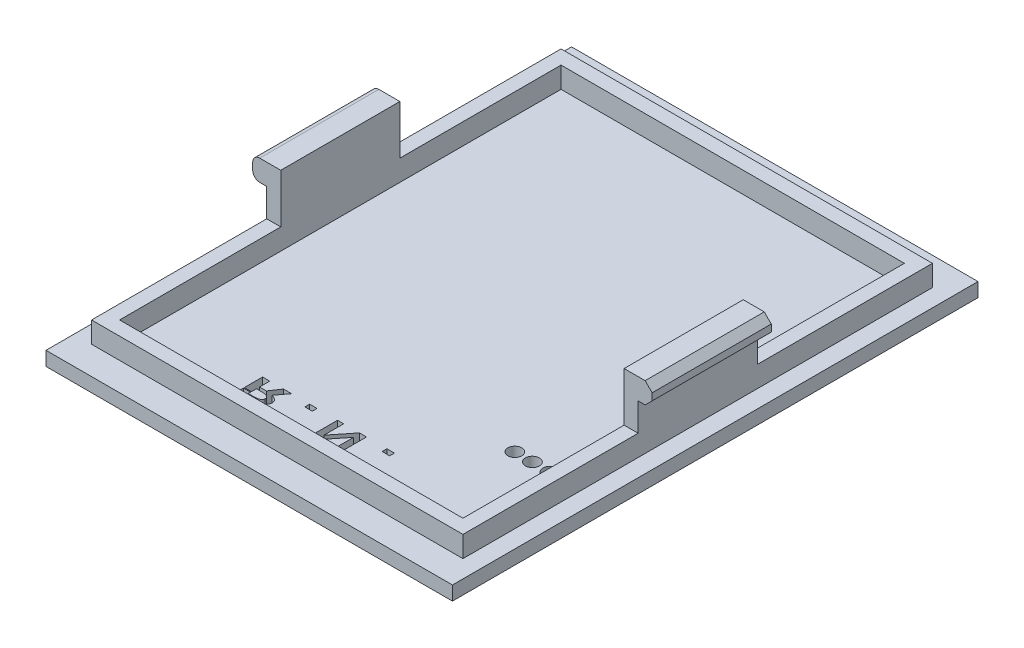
from build123d import *

# Parameters (mm, degrees)
ESQUISSE1_W             = 58
ESQUISSE1_H             = 75
BOSS_EXTRU_1_DEPTH      = 2
ESQUISSE4_W             = 53
ESQUISSE4_H             = 67
BOSS_EXTRU_3_DEPTH      = 3
ESQUISSE5_W             = 49
ESQUISSE5_H             = 63
ENL_V_MAT_EXTRU_1_DEPTH = 3
ESQUISSE6_W             = 2
ESQUISSE6_H             = 17
BOSS_EXTRU_4_DEPTH      = 7
ESQUISSE7_W             = 17
ESQUISSE7_H             = 3
BOSS_EXTRU_5_DEPTH      = 2
ESQUISSE9_W             = 17
ESQUISSE9_H             = 3
BOSS_EXTRU_6_DEPTH      = 2
CHANFREIN1_SIZE         = 1
CONG_1_R                = 1
ESQUISSE13_W            = 1.069444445
ESQUISSE13_H            = 0.680555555
ESQUISSE13_W_2          = 1.069444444
ENL_V_MAT_EXTRU_3_DEPTH = 2
ESQUISSE14_W            = 1.230739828
ESQUISSE14_H            = 0.123680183
BOSS_EXTRU_7_DEPTH      = 2
ESQUISSE15_R            = 1
ESQUISSE15_R_2          = 0.992008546
ENL_V_MAT_EXTRU_4_DEPTH = 10


with BuildPart() as part:
    # Esquisse1 → Boss.-Extru.1 (new body)
    with BuildSketch(Plane(origin=(0, 0, 0), x_dir=(1, 0, 0), z_dir=(0, 1, 0))):
        with Locations((29, 37.5)):
            Rectangle(ESQUISSE1_W, ESQUISSE1_H)
    extrude(amount=BOSS_EXTRU_1_DEPTH)

    # Esquisse4 → Boss.-Extru.3 (add)
    with BuildSketch(Plane(origin=(0, 2, 0), x_dir=(1, 0, 0), z_dir=(0, 1, 0))):
        with Locations((29, 37.5)):
            Rectangle(ESQUISSE4_W, ESQUISSE4_H)
    extrude(amount=BOSS_EXTRU_3_DEPTH)

    # Esquisse5 → Enl_v. mat.-Extru.1 (cut)
    with BuildSketch(Plane(origin=(0, 5, 0), x_dir=(1, 0, 0), z_dir=(0, 1, 0))):
        with Locations((29, 37.5)):
            Rectangle(ESQUISSE5_W, ESQUISSE5_H)
    extrude(amount=-ENL_V_MAT_EXTRU_1_DEPTH, mode=Mode.SUBTRACT)

    # Esquisse6 → Boss.-Extru.4 (add)
    with BuildSketch(Plane(origin=(0, 5, 0), x_dir=(1, 0, 0), z_dir=(0, 1, 0))):
        with Locations((54.5, 37.5)):
            Rectangle(ESQUISSE6_W, ESQUISSE6_H)
        with Locations((3.5, 37.5)):
            Rectangle(ESQUISSE6_W, ESQUISSE6_H)
    extrude(amount=BOSS_EXTRU_4_DEPTH)

    # Esquisse7 → Boss.-Extru.5 (add)
    with BuildSketch(Plane.ZY.offset(-2.5)):
        with Locations((-37.5, 10.5)):
            Rectangle(ESQUISSE7_W, ESQUISSE7_H)
    extrude(amount=BOSS_EXTRU_5_DEPTH)

    # Esquisse9 → Boss.-Extru.6 (add)
    with BuildSketch(Plane(origin=(55.5, 0, 0), x_dir=(0, 0, -1), z_dir=(1, 0, 0))):
        with Locations((37.5, 10.5)):
            Rectangle(ESQUISSE9_W, ESQUISSE9_H)
    extrude(amount=BOSS_EXTRU_6_DEPTH)

    # Chanfrein1
    chanfrein1_edges = [part.edges().sort_by_distance(p)[0] for p in [
        (57.5, 12, -37.5),
        (57.5, 9, -37.5),
    ]]
    chamfer(chanfrein1_edges, length=CHANFREIN1_SIZE)

    # Cong_1
    cong_1_edges = [part.edges().sort_by_distance(p)[0] for p in [
        (0.5, 12, -37.5),
        (0.5, 9, -37.5),
    ]]
    fillet(cong_1_edges, radius=CONG_1_R)

    # Esquisse13 → Enl_v. mat.-Extru.3 (cut)
    # profile 1 of 4: a face of its own
    with BuildSketch(Plane.XZ):
        with BuildLine():
            Line((18.752047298, -8.6557881), (20.641044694, -8.6557881))
            add(Edge.make_bspline(
                [(20.641044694, -8.6557881), (20.723596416, -8.656423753), (20.883479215, -8.657654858), (21.114859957, -8.66971253), (21.329459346, -8.690252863), (21.52747861, -8.717308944), (21.708096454, -8.754927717), (21.872801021, -8.798065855), (22.020153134, -8.851081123), (22.151383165, -8.911699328), (22.26610051, -8.980670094), (22.36691162, -9.055289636), (22.450775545, -9.1391875), (22.521838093, -9.228424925), (22.57487537, -9.326719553), (22.613480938, -9.431493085), (22.63679692, -9.543437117), (22.639537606, -9.620556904), (22.640936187, -9.659911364)],
                knots=[0, 0, 0, 0, 1.59264089, 3.084561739, 4.468382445, 5.751233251, 6.938206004, 8.025987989, 9.033447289, 9.955645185, 10.810140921, 11.612234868, 12.368689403, 13.092732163, 13.805381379, 14.513192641, 15.241277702, 16, 16, 16, 16], degree=3))
            add(Edge.make_bspline(
                [(22.640936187, -9.659911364), (22.640265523, -9.686544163), (22.638949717, -9.738796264), (22.62679218, -9.815532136), (22.608979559, -9.889485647), (22.582898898, -9.960529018), (22.549309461, -10.028531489), (22.507962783, -10.093203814), (22.459561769, -10.155134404), (22.404305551, -10.214874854), (22.339692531, -10.269495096), (22.269692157, -10.323587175), (22.191461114, -10.373254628), (22.105641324, -10.419533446), (22.013001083, -10.463770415), (21.912319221, -10.504337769), (21.804908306, -10.543508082), (21.729867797, -10.565461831), (21.691500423, -10.576686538)],
                knots=[0, 0, 0, 0, 0.895674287, 1.757264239, 2.608682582, 3.452391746, 4.298335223, 5.156378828, 6.030724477, 6.94099164, 7.889228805, 8.874231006, 9.916566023, 11.003231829, 12.154235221, 13.369425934, 14.65501685, 16, 16, 16, 16], degree=3))
            Line((21.691500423, -10.576686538), (22.883991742, -12.1557881))
            Line((22.883991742, -12.1557881), (21.726439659, -12.1557881))
            Line((21.726439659, -12.1557881), (20.745862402, -10.697454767))
            Line((20.745862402, -10.697454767), (19.772880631, -10.697454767))
            Line((19.772880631, -10.697454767), (19.772880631, -12.1557881))
            Line((19.772880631, -12.1557881), (18.752047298, -12.1557881))
            Line((18.752047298, -12.1557881), (18.752047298, -8.6557881))
        make_face()
        with BuildLine():
            Line((19.772880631, -9.0932881), (19.772880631, -10.259954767))
            Line((19.772880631, -10.259954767), (20.575723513, -10.259954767))
            add(Edge.make_bspline(
                [(20.575723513, -10.259954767), (20.619035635, -10.259696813), (20.702963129, -10.259196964), (20.824326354, -10.250282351), (20.936975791, -10.237944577), (21.040539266, -10.219871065), (21.135275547, -10.196416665), (21.221290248, -10.167828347), (21.298603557, -10.133864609), (21.366486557, -10.094026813), (21.426314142, -10.050532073), (21.478222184, -10.003560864), (21.521898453, -9.952922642), (21.558145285, -9.899637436), (21.58566837, -9.842715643), (21.605439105, -9.782981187), (21.618272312, -9.719954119), (21.61948416, -9.67668501), (21.620102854, -9.654594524)],
                knots=[0, 0, 0, 0, 1.542067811, 2.988121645, 4.331345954, 5.576544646, 6.729006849, 7.803944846, 8.80091632, 9.730321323, 10.601387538, 11.431106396, 12.217409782, 12.977639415, 13.719631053, 14.460964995, 15.214265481, 16, 16, 16, 16], degree=3))
            add(Edge.make_bspline(
                [(21.620102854, -9.654594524), (21.619457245, -9.632006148), (21.618192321, -9.587749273), (21.605809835, -9.523510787), (21.585154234, -9.463741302), (21.556624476, -9.408185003), (21.520171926, -9.356853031), (21.474250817, -9.311250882), (21.421621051, -9.268890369), (21.36012895, -9.232194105), (21.291639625, -9.19818799), (21.214114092, -9.170778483), (21.1289688, -9.146281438), (21.035494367, -9.126940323), (20.934067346, -9.111726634), (20.824758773, -9.101642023), (20.707474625, -9.0944098), (20.626625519, -9.093670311), (20.584838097, -9.0932881)],
                knots=[0, 0, 0, 0, 0.821962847, 1.610452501, 2.37156193, 3.118007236, 3.877998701, 4.653933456, 5.467578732, 6.332634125, 7.256392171, 8.248238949, 9.322316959, 10.481561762, 11.721743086, 13.055827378, 14.47828394, 16, 16, 16, 16], degree=3))
            Line((20.584838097, -9.0932881), (19.772880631, -9.0932881))
        make_face(mode=Mode.SUBTRACT)
    # profile 2 of 4: a face of its own
    with BuildSketch(Plane.XZ):
        with Locations((25.995102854, -11.815510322)):
            Rectangle(ESQUISSE13_W, ESQUISSE13_H)
    # profile 3 of 4: a face of its own
    with BuildSketch(Plane.XZ):
        Polygon((29.446491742, -8.6557881), (30.679998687, -8.6557881), (32.703436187, -11.179008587), (32.703436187, -8.6557881), (33.578436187, -8.6557881), (33.578436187, -12.1557881), (32.569755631, -12.1557881), (30.321491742, -9.353053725), (30.321491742, -12.1557881), (29.446491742, -12.1557881), align=None)
    # profile 4 of 4: a face of its own
    with BuildSketch(Plane.XZ):
        with Locations((37.029825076, -11.815510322)):
            Rectangle(ESQUISSE13_W_2, ESQUISSE13_H)
    extrude(amount=-ENL_V_MAT_EXTRU_3_DEPTH, mode=Mode.SUBTRACT)


with BuildPart() as enl_v_mat_extru_3_piece_1:
    # of the separate pieces the step leaves, piece 1, a body of its own (enl_v_mat_extru_3_pieces)
    add(part.part.solids().sort_by_distance((1.5, 12, -29))[0])



with BuildPart() as enl_v_mat_extru_3_piece_2:
    # of the separate pieces the step leaves, piece 2, a body of its own (enl_v_mat_extru_3_pieces)
    add(part.part.solids().sort_by_distance((19.772880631, 2, -9.0932881))[0])


with BuildPart() as enl_v_mat_extru_3_piece_1_1:
    add(enl_v_mat_extru_3_piece_1.part)

    add(enl_v_mat_extru_3_piece_2.part)  # Boss.-Extru.7 merges Enl_v. mat.-Extru.3 piece 2
    # Esquisse14 → Boss.-Extru.7 (add)
    with BuildSketch(Plane(origin=(0, 0, 0), x_dir=(-1, 0, 0), z_dir=(0, -1, 0))):
        with Locations((-19.28087204, 9.479178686)):
            Rectangle(ESQUISSE14_W, ESQUISSE14_H)
    extrude(amount=-BOSS_EXTRU_7_DEPTH)

    # Esquisse15 → Enl_v. mat.-Extru.4 (cut)
    with BuildSketch(Plane(origin=(0, 2, 0), x_dir=(1, 0, 0), z_dir=(0, 1, 0))):
        with Locations(Location((51, 20.908478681, 0), (0, 0, 270))):
            Circle(ESQUISSE15_R)
        with Locations(Location((48.5, 20.908478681, 0), (0, 0, 270))):
            Circle(ESQUISSE15_R)
        with Locations(Location((46, 20.908478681, 0), (0, 0, 270))):
            Circle(ESQUISSE15_R_2)
    extrude(amount=-ENL_V_MAT_EXTRU_4_DEPTH, mode=Mode.SUBTRACT)


solid = enl_v_mat_extru_3_piece_1_1.part
